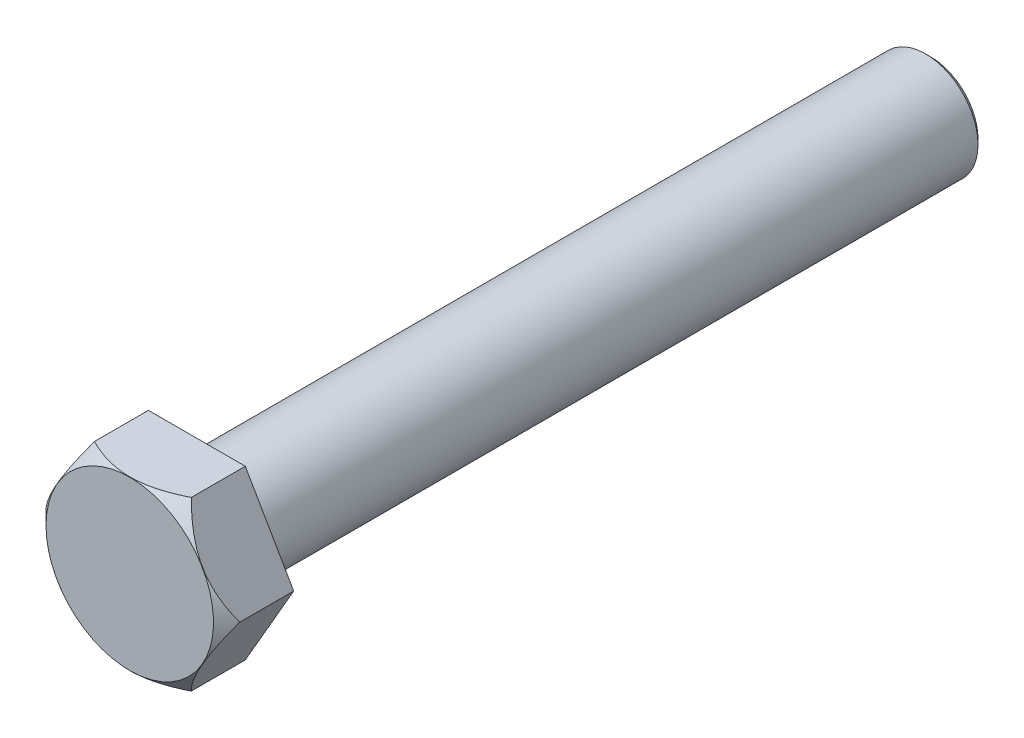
from build123d import *

# Parameters (mm, degrees)
BOSS_EXTRU_1_DEPTH = 6.4


with BuildPart() as part:
    # Esquisse1 → Boss.-Extru.1 (new body)
    with BuildSketch(Plane.XY):
        Polygon((9.237604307, 0), (4.618802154, 8), (-4.618802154, 8), (-9.237604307, 0), (-4.618802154, -8), (4.618802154, -8), align=None)
    extrude(amount=BOSS_EXTRU_1_DEPTH)

    # Esquisse3 → Enl_vement de mati_re-R_volution2 (revolve, cut)
    with BuildSketch(Plane(origin=(0, 0, 0), x_dir=(1, 0, 0), z_dir=(0, 1, 0))):
        Polygon((-9.237604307, -5.15), (-7.987604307, -6.4), (-7.987604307, -8.078189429), (-10.154335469, -8.078189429), (-10.154335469, -5.15), align=None)
    revolve(axis=Axis((0, 0, -2.903094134), (0, 0, 1)), mode=Mode.SUBTRACT)


with BuildPart() as body_2:
    # Esquisse4 → R_volution2 (revolve)
    with BuildSketch(Plane(origin=(0, 0, 0), x_dir=(0, 0, -1), z_dir=(1, 0, 0)), mode=Mode.PRIVATE) as r_volution2_sk:
        Polygon((0, -5), (69.5, -5), (70, -4.5), (70, 0), (0, 0), align=None)
    revolve(r_volution2_sk.sketch.rotate(Axis((0, 0, 0), (0, 0, -1)), 270), axis=Axis((0, 0, 0), (0, 0, -1)))


solid = Compound([part.part, body_2.part])
